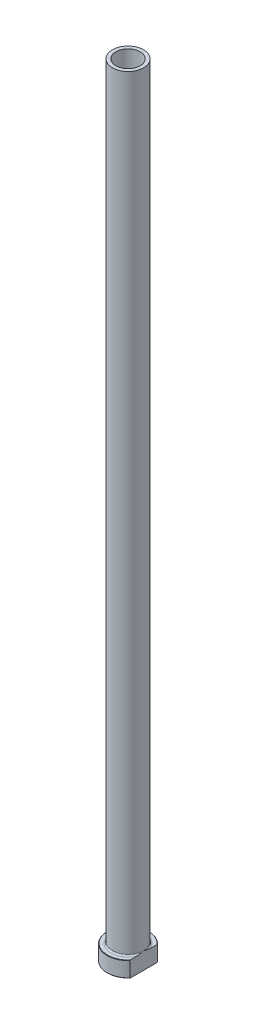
ISO-10303-21;
HEADER;
FILE_DESCRIPTION(('STEP AP214'),'2;1');
FILE_NAME('part.step','',(''),(''),'','','');
FILE_SCHEMA(('AUTOMOTIVE_DESIGN { 1 0 10303 214 1 1 1 1 }'));
ENDSEC;
DATA;
#1=APPLICATION_CONTEXT('core data for automotive mechanical design processes');
#2=APPLICATION_PROTOCOL_DEFINITION('international standard','automotive_design',2000,#1);
#3=PRODUCT_CONTEXT('',#1,'mechanical');
#4=PRODUCT('Part','Part','',(#3));
#5=PRODUCT_RELATED_PRODUCT_CATEGORY('part','',(#4));
#6=PRODUCT_DEFINITION_FORMATION('','',#4);
#7=PRODUCT_DEFINITION_CONTEXT('part definition',#1,'design');
#8=PRODUCT_DEFINITION('design','',#6,#7);
#9=PRODUCT_DEFINITION_SHAPE('','',#8);
#10=(LENGTH_UNIT() NAMED_UNIT(*) SI_UNIT(.MILLI.,.METRE.));
#11=(NAMED_UNIT(*) PLANE_ANGLE_UNIT() SI_UNIT($,.RADIAN.));
#12=(NAMED_UNIT(*) SI_UNIT($,.STERADIAN.) SOLID_ANGLE_UNIT());
#13=UNCERTAINTY_MEASURE_WITH_UNIT(LENGTH_MEASURE(1.E-05),#10,'distance_accuracy_value','');
#14=(GEOMETRIC_REPRESENTATION_CONTEXT(3) GLOBAL_UNCERTAINTY_ASSIGNED_CONTEXT((#13)) GLOBAL_UNIT_ASSIGNED_CONTEXT((#10,
#11,#12)) REPRESENTATION_CONTEXT('',''));
#15=CARTESIAN_POINT('',(0.,0.,0.));
#16=DIRECTION('',(0.,0.,1.));
#17=DIRECTION('',(1.,0.,0.));
#18=AXIS2_PLACEMENT_3D('',#15,#16,#17);
#19=CARTESIAN_POINT('',(0.,92.1876809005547,0.));
#20=DIRECTION('',(0.,1.,0.));
#21=DIRECTION('',(0.,0.,1.));
#22=AXIS2_PLACEMENT_3D('',#19,#20,#21);
#23=CYLINDRICAL_SURFACE('',#22,7.00000000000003);
#24=CARTESIAN_POINT('',(0.,450.,0.));
#25=DIRECTION('',(0.,1.,0.));
#26=DIRECTION('',(0.,0.,1.));
#27=AXIS2_PLACEMENT_3D('',#24,#25,#26);
#28=CIRCLE('',#27,7.00000000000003);
#29=CARTESIAN_POINT('',(0.,450.,7.00000000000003));
#30=VERTEX_POINT('',#29);
#31=EDGE_CURVE('E167',#30,#30,#28,.T.);
#32=ORIENTED_EDGE('',*,*,#31,.T.);
#33=EDGE_LOOP('',(#32));
#34=FACE_BOUND('',#33,.T.);
#35=CARTESIAN_POINT('',(0.,395.,0.));
#36=DIRECTION('',(0.,1.,0.));
#37=DIRECTION('',(0.,0.,1.));
#38=AXIS2_PLACEMENT_3D('',#35,#36,#37);
#39=CIRCLE('',#38,7.00000000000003);
#40=CARTESIAN_POINT('',(0.,395.,7.00000000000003));
#41=VERTEX_POINT('',#40);
#42=EDGE_CURVE('E170',#41,#41,#39,.T.);
#43=ORIENTED_EDGE('',*,*,#42,.F.);
#44=EDGE_LOOP('',(#43));
#45=FACE_BOUND('',#44,.T.);
#46=ADVANCED_FACE('F32',(#34,#45),#23,.F.);
#47=CARTESIAN_POINT('',(-7.00000000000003,450.,0.));
#48=DIRECTION('',(0.,1.,0.));
#49=DIRECTION('',(0.,0.,1.));
#50=AXIS2_PLACEMENT_3D('',#47,#48,#49);
#51=PLANE('',#50);
#52=CARTESIAN_POINT('',(0.,450.,0.));
#53=DIRECTION('',(0.,1.,0.));
#54=DIRECTION('',(0.,0.,1.));
#55=AXIS2_PLACEMENT_3D('',#52,#53,#54);
#56=CIRCLE('',#55,9.00000000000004);
#57=CARTESIAN_POINT('',(0.,450.,9.00000000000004));
#58=VERTEX_POINT('',#57);
#59=EDGE_CURVE('E174',#58,#58,#56,.T.);
#60=ORIENTED_EDGE('',*,*,#59,.T.);
#61=EDGE_LOOP('',(#60));
#62=FACE_BOUND('',#61,.T.);
#63=ORIENTED_EDGE('',*,*,#31,.F.);
#64=EDGE_LOOP('',(#63));
#65=FACE_BOUND('',#64,.T.);
#66=ADVANCED_FACE('F157',(#62,#65),#51,.T.);
#67=CARTESIAN_POINT('',(0.,92.1876809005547,0.));
#68=DIRECTION('',(0.,1.,0.));
#69=DIRECTION('',(0.,0.,1.));
#70=AXIS2_PLACEMENT_3D('',#67,#68,#69);
#71=CYLINDRICAL_SURFACE('',#70,9.00000000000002);
#72=CARTESIAN_POINT('',(0.,9.8,0.));
#73=DIRECTION('',(0.,1.,0.));
#74=DIRECTION('',(0.,0.,1.));
#75=AXIS2_PLACEMENT_3D('',#72,#73,#74);
#76=CIRCLE('',#75,9.00000000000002);
#77=CARTESIAN_POINT('',(9.00000000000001,9.8,0.));
#78=VERTEX_POINT('',#77);
#79=EDGE_CURVE('E180',#78,#78,#76,.T.);
#80=ORIENTED_EDGE('',*,*,#79,.T.);
#81=EDGE_LOOP('',(#80));
#82=FACE_BOUND('',#81,.T.);
#83=ORIENTED_EDGE('',*,*,#59,.F.);
#84=EDGE_LOOP('',(#83));
#85=FACE_BOUND('',#84,.T.);
#86=ADVANCED_FACE('F162',(#82,#85),#71,.T.);
#87=CARTESIAN_POINT('',(-8.99999999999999,9.,0.));
#88=DIRECTION('',(0.,1.,0.));
#89=DIRECTION('',(0.,0.,1.));
#90=AXIS2_PLACEMENT_3D('',#87,#88,#89);
#91=PLANE('',#90);
#92=DIRECTION('',(0.,0.,1.));
#93=VECTOR('',#92,1.);
#94=CARTESIAN_POINT('',(9.,9.,0.));
#95=LINE('',#94,#93);
#96=CARTESIAN_POINT('',(9.,9.,-7.63151361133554));
#97=VERTEX_POINT('',#96);
#98=CARTESIAN_POINT('',(9.,9.,-3.87814388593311));
#99=VERTEX_POINT('',#98);
#100=EDGE_CURVE('E54',#97,#99,#95,.T.);
#101=ORIENTED_EDGE('',*,*,#100,.F.);
#102=CARTESIAN_POINT('',(0.,9.,0.));
#103=DIRECTION('',(0.,1.,0.));
#104=DIRECTION('',(0.,0.,1.));
#105=AXIS2_PLACEMENT_3D('',#102,#103,#104);
#106=CIRCLE('',#105,11.8);
#107=CARTESIAN_POINT('',(8.99999999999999,9.,7.63151361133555));
#108=VERTEX_POINT('',#107);
#109=EDGE_CURVE('E186',#97,#108,#106,.T.);
#110=ORIENTED_EDGE('',*,*,#109,.T.);
#111=CARTESIAN_POINT('',(9.,9.,3.87814388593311));
#112=VERTEX_POINT('',#111);
#113=EDGE_CURVE('E134',#112,#108,#95,.T.);
#114=ORIENTED_EDGE('',*,*,#113,.F.);
#115=CARTESIAN_POINT('',(0.,9.,0.));
#116=DIRECTION('',(0.,1.,0.));
#117=DIRECTION('',(0.,0.,1.));
#118=AXIS2_PLACEMENT_3D('',#115,#116,#117);
#119=CIRCLE('',#118,9.80000000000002);
#120=EDGE_CURVE('E183',#112,#99,#119,.F.);
#121=ORIENTED_EDGE('',*,*,#120,.T.);
#122=EDGE_LOOP('',(#101,#110,#114,#121));
#123=FACE_BOUND('',#122,.T.);
#124=ADVANCED_FACE('F197',(#123),#91,.T.);
#125=CARTESIAN_POINT('',(0.,92.1876809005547,0.));
#126=DIRECTION('',(0.,1.,0.));
#127=DIRECTION('',(0.,0.,1.));
#128=AXIS2_PLACEMENT_3D('',#125,#126,#127);
#129=CYLINDRICAL_SURFACE('',#128,12.);
#130=DIRECTION('',(0.,-1.,0.));
#131=VECTOR('',#130,1.);
#132=CARTESIAN_POINT('',(8.99999999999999,450.,7.93725393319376));
#133=LINE('',#132,#131);
#134=CARTESIAN_POINT('',(8.99999999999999,8.79999999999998,7.93725393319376));
#135=VERTEX_POINT('',#134);
#136=CARTESIAN_POINT('',(8.99999999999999,0.199999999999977,7.93725393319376));
#137=VERTEX_POINT('',#136);
#138=EDGE_CURVE('E82',#135,#137,#133,.T.);
#139=ORIENTED_EDGE('',*,*,#138,.F.);
#140=CARTESIAN_POINT('',(0.,8.79999999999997,0.));
#141=DIRECTION('',(0.,1.,0.));
#142=DIRECTION('',(0.,0.,1.));
#143=AXIS2_PLACEMENT_3D('',#140,#141,#142);
#144=CIRCLE('',#143,12.);
#145=CARTESIAN_POINT('',(9.,8.79999999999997,-7.93725393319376));
#146=VERTEX_POINT('',#145);
#147=EDGE_CURVE('E95',#135,#146,#144,.F.);
#148=ORIENTED_EDGE('',*,*,#147,.T.);
#149=DIRECTION('',(0.,-1.,0.));
#150=VECTOR('',#149,1.);
#151=CARTESIAN_POINT('',(9.,450.,-7.93725393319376));
#152=LINE('',#151,#150);
#153=CARTESIAN_POINT('',(9.,0.199999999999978,-7.93725393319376));
#154=VERTEX_POINT('',#153);
#155=EDGE_CURVE('E192',#146,#154,#152,.T.);
#156=ORIENTED_EDGE('',*,*,#155,.T.);
#157=CARTESIAN_POINT('',(0.,0.199999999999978,0.));
#158=DIRECTION('',(0.,-1.,0.));
#159=DIRECTION('',(0.,0.,-1.));
#160=AXIS2_PLACEMENT_3D('',#157,#158,#159);
#161=CIRCLE('',#160,12.);
#162=EDGE_CURVE('E98',#154,#137,#161,.F.);
#163=ORIENTED_EDGE('',*,*,#162,.T.);
#164=EDGE_LOOP('',(#139,#148,#156,#163));
#165=FACE_BOUND('',#164,.T.);
#166=ADVANCED_FACE('F190',(#165),#129,.T.);
#167=CARTESIAN_POINT('',(-12.,0.,0.));
#168=DIRECTION('',(0.,-1.,0.));
#169=DIRECTION('',(0.,0.,-1.));
#170=AXIS2_PLACEMENT_3D('',#167,#168,#169);
#171=PLANE('',#170);
#172=CARTESIAN_POINT('',(0.,0.,0.));
#173=DIRECTION('',(0.,-1.,0.));
#174=DIRECTION('',(0.,0.,-1.));
#175=AXIS2_PLACEMENT_3D('',#172,#173,#174);
#176=CIRCLE('',#175,7.74999999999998);
#177=CARTESIAN_POINT('',(0.,0.,-7.74999999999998));
#178=VERTEX_POINT('',#177);
#179=EDGE_CURVE('E40',#178,#178,#176,.F.);
#180=ORIENTED_EDGE('',*,*,#179,.T.);
#181=EDGE_LOOP('',(#180));
#182=FACE_BOUND('',#181,.T.);
#183=DIRECTION('',(0.,0.,-1.));
#184=VECTOR('',#183,1.);
#185=CARTESIAN_POINT('',(8.99999999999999,0.,7.93725393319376));
#186=LINE('',#185,#184);
#187=CARTESIAN_POINT('',(8.99999999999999,0.,7.63151361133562));
#188=VERTEX_POINT('',#187);
#189=CARTESIAN_POINT('',(9.,0.,-7.63151361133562));
#190=VERTEX_POINT('',#189);
#191=EDGE_CURVE('E47',#188,#190,#186,.T.);
#192=ORIENTED_EDGE('',*,*,#191,.F.);
#193=CARTESIAN_POINT('',(0.,0.,0.));
#194=DIRECTION('',(0.,-1.,0.));
#195=DIRECTION('',(0.,0.,-1.));
#196=AXIS2_PLACEMENT_3D('',#193,#194,#195);
#197=CIRCLE('',#196,11.8);
#198=EDGE_CURVE('E92',#188,#190,#197,.T.);
#199=ORIENTED_EDGE('',*,*,#198,.T.);
#200=EDGE_LOOP('',(#192,#199));
#201=FACE_BOUND('',#200,.T.);
#202=ADVANCED_FACE('F91',(#182,#201),#171,.T.);
#203=CARTESIAN_POINT('',(0.,92.1876809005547,0.));
#204=DIRECTION('',(0.,1.,0.));
#205=DIRECTION('',(0.,0.,1.));
#206=AXIS2_PLACEMENT_3D('',#203,#204,#205);
#207=CYLINDRICAL_SURFACE('',#206,7.25000000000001);
#208=CARTESIAN_POINT('',(0.,0.499999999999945,0.));
#209=DIRECTION('',(0.,-1.,0.));
#210=DIRECTION('',(0.,0.,-1.));
#211=AXIS2_PLACEMENT_3D('',#208,#209,#210);
#212=CIRCLE('',#211,7.25000000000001);
#213=CARTESIAN_POINT('',(0.,0.499999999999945,-7.25000000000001));
#214=VERTEX_POINT('',#213);
#215=EDGE_CURVE('E11',#214,#214,#212,.T.);
#216=ORIENTED_EDGE('',*,*,#215,.T.);
#217=EDGE_LOOP('',(#216));
#218=FACE_BOUND('',#217,.T.);
#219=CARTESIAN_POINT('',(0.,383.,0.));
#220=DIRECTION('',(0.,1.,0.));
#221=DIRECTION('',(0.,0.,1.));
#222=AXIS2_PLACEMENT_3D('',#219,#220,#221);
#223=CIRCLE('',#222,7.25000000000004);
#224=CARTESIAN_POINT('',(0.,383.,7.25000000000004));
#225=VERTEX_POINT('',#224);
#226=EDGE_CURVE('E172',#225,#225,#223,.T.);
#227=ORIENTED_EDGE('',*,*,#226,.T.);
#228=EDGE_LOOP('',(#227));
#229=FACE_BOUND('',#228,.T.);
#230=ADVANCED_FACE('F215',(#218,#229),#207,.F.);
#231=CARTESIAN_POINT('',(0.,383.,0.));
#232=DIRECTION('',(0.,-1.,0.));
#233=DIRECTION('',(0.,0.,-1.));
#234=AXIS2_PLACEMENT_3D('',#231,#232,#233);
#235=CONICAL_SURFACE('',#234,7.25000000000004,0.0208303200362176);
#236=ORIENTED_EDGE('',*,*,#42,.T.);
#237=EDGE_LOOP('',(#236));
#238=FACE_BOUND('',#237,.T.);
#239=ORIENTED_EDGE('',*,*,#226,.F.);
#240=EDGE_LOOP('',(#239));
#241=FACE_BOUND('',#240,.T.);
#242=ADVANCED_FACE('F111',(#238,#241),#235,.F.);
#243=CARTESIAN_POINT('',(0.,9.8,0.));
#244=DIRECTION('',(0.,1.,0.));
#245=DIRECTION('',(0.,0.,1.));
#246=AXIS2_PLACEMENT_3D('',#243,#244,#245);
#247=TOROIDAL_SURFACE('',#246,9.80000000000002,0.8);
#248=ORIENTED_EDGE('',*,*,#120,.F.);
#249=CARTESIAN_POINT('',(9.00000000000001,9.8,0.));
#250=CARTESIAN_POINT('',(9.00000000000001,9.80000101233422,-6.46830621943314E-11));
#251=CARTESIAN_POINT('',(9.00000000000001,9.80000202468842,3.1733283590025E-07));
#252=CARTESIAN_POINT('',(9.00000000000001,9.80000393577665,1.24154807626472E-06));
#253=CARTESIAN_POINT('',(9.00000000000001,9.80000482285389,1.86583130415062E-06));
#254=CARTESIAN_POINT('',(9.00000000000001,9.80000663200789,3.3564144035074E-06));
#255=CARTESIAN_POINT('',(9.00000000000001,9.80000753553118,4.24567538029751E-06));
#256=CARTESIAN_POINT('',(9.00000000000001,9.80000918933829,6.1161236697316E-06));
#257=CARTESIAN_POINT('',(9.00000000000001,9.80000994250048,7.09492192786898E-06));
#258=CARTESIAN_POINT('',(9.00000000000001,9.80001263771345,1.07802732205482E-05));
#259=CARTESIAN_POINT('',(9.00000000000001,9.80001442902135,1.36008627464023E-05));
#260=CARTESIAN_POINT('',(9.00000000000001,9.80001746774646,1.9272257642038E-05));
#261=CARTESIAN_POINT('',(9.00000000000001,9.80001874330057,2.21087258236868E-05));
#262=CARTESIAN_POINT('',(9.00000000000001,9.80002390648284,3.37975105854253E-05));
#263=CARTESIAN_POINT('',(9.,9.80002763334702,4.27293258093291E-05));
#264=CARTESIAN_POINT('',(9.,9.80003330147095,5.98324910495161E-05));
#265=CARTESIAN_POINT('',(9.,9.80003541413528,6.79473053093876E-05));
#266=CARTESIAN_POINT('',(9.00000000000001,9.80005049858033,0.000127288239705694));
#267=CARTESIAN_POINT('',(9.,9.80006163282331,0.000178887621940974));
#268=CARTESIAN_POINT('',(8.99999999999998,9.80011034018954,0.000381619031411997));
#269=CARTESIAN_POINT('',(8.99999999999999,9.80015710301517,0.000530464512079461));
#270=CARTESIAN_POINT('',(9.00000000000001,9.80033804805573,0.00111728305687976));
#271=CARTESIAN_POINT('',(9.,9.80046603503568,0.00155660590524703));
#272=CARTESIAN_POINT('',(8.99999999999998,9.80097635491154,0.00329406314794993));
#273=CARTESIAN_POINT('',(8.99999999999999,9.8013663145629,0.00459050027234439));
#274=CARTESIAN_POINT('',(9.00000000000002,9.80298403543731,0.00998416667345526));
#275=CARTESIAN_POINT('',(9.00000000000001,9.80420236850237,0.0140834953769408));
#276=CARTESIAN_POINT('',(8.99999999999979,9.8264866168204,0.0890427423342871));
#277=CARTESIAN_POINT('',(8.99999999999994,9.84764626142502,0.15988211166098));
#278=CARTESIAN_POINT('',(9.00000000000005,9.88895908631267,0.298764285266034));
#279=CARTESIAN_POINT('',(9.00000000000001,9.90911860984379,0.366805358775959));
#280=CARTESIAN_POINT('',(8.99999999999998,9.95179311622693,0.511524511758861));
#281=CARTESIAN_POINT('',(8.99999999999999,9.97428452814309,0.588209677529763));
#282=CARTESIAN_POINT('',(9.,10.0191408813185,0.742532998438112));
#283=CARTESIAN_POINT('',(9.,10.0415017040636,0.820172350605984));
#284=CARTESIAN_POINT('',(9.,10.0794112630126,0.953448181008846));
#285=CARTESIAN_POINT('',(9.,10.0950851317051,1.00904901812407));
#286=CARTESIAN_POINT('',(9.,10.1260784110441,1.12019530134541));
#287=CARTESIAN_POINT('',(9.,10.141398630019,1.17574052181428));
#288=CARTESIAN_POINT('',(9.,10.1860703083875,1.33980716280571));
#289=CARTESIAN_POINT('',(9.,10.2149083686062,1.4484686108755));
#290=CARTESIAN_POINT('',(9.,10.2856369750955,1.7241783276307));
#291=CARTESIAN_POINT('',(9.,10.3263124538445,1.89154391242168));
#292=CARTESIAN_POINT('',(9.,10.4020454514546,2.22904779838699));
#293=CARTESIAN_POINT('',(9.,10.4370523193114,2.3991975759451));
#294=CARTESIAN_POINT('',(9.,10.5014391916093,2.75494052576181));
#295=CARTESIAN_POINT('',(9.,10.5301301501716,2.94066439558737));
#296=CARTESIAN_POINT('',(9.,10.5633122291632,3.22016202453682));
#297=CARTESIAN_POINT('',(9.,10.5727244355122,3.3133533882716));
#298=CARTESIAN_POINT('',(9.,10.5877042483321,3.5000389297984));
#299=CARTESIAN_POINT('',(9.,10.5932725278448,3.59353305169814));
#300=CARTESIAN_POINT('',(9.,10.5997812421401,3.77831079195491));
#301=CARTESIAN_POINT('',(9.,10.6008358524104,3.86959010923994));
#302=CARTESIAN_POINT('',(9.,10.5977997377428,4.05215299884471));
#303=CARTESIAN_POINT('',(8.99999999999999,10.5937049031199,4.14343651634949));
#304=CARTESIAN_POINT('',(8.99999999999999,10.5793848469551,4.32415905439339));
#305=CARTESIAN_POINT('',(8.99999999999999,10.5692536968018,4.41360502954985));
#306=CARTESIAN_POINT('',(8.99999999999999,10.5415393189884,4.59125765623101));
#307=CARTESIAN_POINT('',(8.99999999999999,10.5239649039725,4.67946564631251));
#308=CARTESIAN_POINT('',(8.99999999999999,10.4790565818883,4.8547188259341));
#309=CARTESIAN_POINT('',(8.99999999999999,10.4516029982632,4.94173554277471));
#310=CARTESIAN_POINT('',(8.99999999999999,10.4007972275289,5.06830195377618));
#311=CARTESIAN_POINT('',(8.99999999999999,10.3822808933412,5.10979172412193));
#312=CARTESIAN_POINT('',(8.99999999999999,10.3414775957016,5.19085457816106));
#313=CARTESIAN_POINT('',(8.99999999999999,10.319195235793,5.23042992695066));
#314=CARTESIAN_POINT('',(8.99999999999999,10.2750362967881,5.29920261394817));
#315=CARTESIAN_POINT('',(8.99999999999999,10.2539514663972,5.32890420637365));
#316=CARTESIAN_POINT('',(8.99999999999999,10.2085010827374,5.38577147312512));
#317=CARTESIAN_POINT('',(8.99999999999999,10.1841327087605,5.412934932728));
#318=CARTESIAN_POINT('',(8.99999999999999,10.1314615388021,5.46389233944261));
#319=CARTESIAN_POINT('',(8.99999999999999,10.103115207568,5.48764214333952));
#320=CARTESIAN_POINT('',(8.99999999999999,10.0426124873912,5.52966859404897));
#321=CARTESIAN_POINT('',(8.99999999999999,10.0104678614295,5.54796155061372));
#322=CARTESIAN_POINT('',(8.99999999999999,9.95377518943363,5.57238639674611));
#323=CARTESIAN_POINT('',(8.99999999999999,9.93009823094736,5.58053697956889));
#324=CARTESIAN_POINT('',(8.99999999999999,9.88171464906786,5.59278453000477));
#325=CARTESIAN_POINT('',(8.99999999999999,9.85700894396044,5.59688503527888));
#326=CARTESIAN_POINT('',(8.99999999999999,9.80717489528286,5.6006769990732));
#327=CARTESIAN_POINT('',(8.99999999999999,9.78204544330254,5.60035415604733));
#328=CARTESIAN_POINT('',(8.99999999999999,9.73223420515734,5.59529565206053));
#329=CARTESIAN_POINT('',(8.99999999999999,9.70755259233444,5.59055831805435));
#330=CARTESIAN_POINT('',(8.99999999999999,9.66020362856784,5.57733425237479));
#331=CARTESIAN_POINT('',(8.99999999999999,9.63749568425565,5.56898983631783));
#332=CARTESIAN_POINT('',(8.99999999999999,9.59351516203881,5.54915687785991));
#333=CARTESIAN_POINT('',(8.99999999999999,9.57224307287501,5.53766727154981));
#334=CARTESIAN_POINT('',(8.99999999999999,9.51928150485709,5.50462580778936));
#335=CARTESIAN_POINT('',(8.99999999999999,9.48880776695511,5.48112661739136));
#336=CARTESIAN_POINT('',(8.99999999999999,9.43189052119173,5.4296533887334));
#337=CARTESIAN_POINT('',(8.99999999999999,9.40546009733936,5.40166539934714));
#338=CARTESIAN_POINT('',(8.99999999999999,9.34005551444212,5.32319042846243));
#339=CARTESIAN_POINT('',(8.99999999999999,9.30430472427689,5.27003866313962));
#340=CARTESIAN_POINT('',(8.99999999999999,9.24095813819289,5.15926391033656));
#341=CARTESIAN_POINT('',(8.99999999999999,9.21336826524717,5.10163771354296));
#342=CARTESIAN_POINT('',(8.99999999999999,9.16551403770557,4.98579619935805));
#343=CARTESIAN_POINT('',(8.99999999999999,9.14502939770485,4.9276701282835));
#344=CARTESIAN_POINT('',(8.99999999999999,9.10900516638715,4.80987690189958));
#345=CARTESIAN_POINT('',(8.99999999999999,9.09347054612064,4.75020826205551));
#346=CARTESIAN_POINT('',(8.99999999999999,9.06639912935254,4.62926355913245));
#347=CARTESIAN_POINT('',(8.99999999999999,9.05491059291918,4.56797688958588));
#348=CARTESIAN_POINT('',(8.99999999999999,9.03554988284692,4.44488746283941));
#349=CARTESIAN_POINT('',(8.99999999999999,9.02767548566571,4.38308504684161));
#350=CARTESIAN_POINT('',(8.99999999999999,9.01237706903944,4.23320098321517));
#351=CARTESIAN_POINT('',(8.99999999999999,9.00652460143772,4.14495990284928));
#352=CARTESIAN_POINT('',(8.99999999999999,8.99996624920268,3.96827125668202));
#353=CARTESIAN_POINT('',(9.,8.99926276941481,3.87982361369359));
#354=CARTESIAN_POINT('',(9.,9.00218728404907,3.70272096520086));
#355=CARTESIAN_POINT('',(9.,9.00582939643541,3.61406622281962));
#356=CARTESIAN_POINT('',(9.,9.01681466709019,3.43698088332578));
#357=CARTESIAN_POINT('',(9.,9.02415848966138,3.34855032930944));
#358=CARTESIAN_POINT('',(9.,9.0498974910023,3.09391807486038));
#359=CARTESIAN_POINT('',(9.,9.07232194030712,2.92812217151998));
#360=CARTESIAN_POINT('',(9.,9.12539895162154,2.59921508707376));
#361=CARTESIAN_POINT('',(9.,9.15598725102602,2.4360930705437));
#362=CARTESIAN_POINT('',(9.,9.22330285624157,2.11182788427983));
#363=CARTESIAN_POINT('',(9.,9.26000471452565,1.95067936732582));
#364=CARTESIAN_POINT('',(9.,9.31897632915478,1.70786584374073));
#365=CARTESIAN_POINT('',(9.,9.33955107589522,1.62578051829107));
#366=CARTESIAN_POINT('',(9.,9.38177259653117,1.46165638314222));
#367=CARTESIAN_POINT('',(9.,9.4034220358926,1.37961825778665));
#368=CARTESIAN_POINT('',(9.,9.45602430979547,1.18435079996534));
#369=CARTESIAN_POINT('',(8.99999999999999,9.48736095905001,1.07122519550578));
#370=CARTESIAN_POINT('',(9.,9.55083956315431,0.846545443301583));
#371=CARTESIAN_POINT('',(9.,9.58296886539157,0.734987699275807));
#372=CARTESIAN_POINT('',(8.99999999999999,9.64431039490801,0.524609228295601));
#373=CARTESIAN_POINT('',(8.99999999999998,9.67344475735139,0.425765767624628));
#374=CARTESIAN_POINT('',(9.00000000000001,9.71808680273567,0.275077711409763));
#375=CARTESIAN_POINT('',(9.00000000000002,9.73349584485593,0.223203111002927));
#376=CARTESIAN_POINT('',(8.99999999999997,9.76415269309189,0.120285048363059));
#377=CARTESIAN_POINT('',(8.99999999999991,9.7793992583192,0.0692412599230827));
#378=CARTESIAN_POINT('',(9.,9.79579831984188,0.0140813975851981));
#379=CARTESIAN_POINT('',(9.00000000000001,9.797017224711,0.00997994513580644));
#380=CARTESIAN_POINT('',(8.99999999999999,9.798635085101,0.00458578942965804));
#381=CARTESIAN_POINT('',(8.99999999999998,9.79902455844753,0.00329097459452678));
#382=CARTESIAN_POINT('',(9.,9.79953428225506,0.00155554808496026));
#383=CARTESIAN_POINT('',(9.00000000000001,9.79966215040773,0.00111663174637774));
#384=CARTESIAN_POINT('',(8.99999999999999,9.79984295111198,0.000530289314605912));
#385=CARTESIAN_POINT('',(8.99999999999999,9.79988969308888,0.000381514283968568));
#386=CARTESIAN_POINT('',(9.,9.79993838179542,0.000178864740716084));
#387=CARTESIAN_POINT('',(9.,9.79994951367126,0.000127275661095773));
#388=CARTESIAN_POINT('',(9.,9.79996459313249,6.79451451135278E-05));
#389=CARTESIAN_POINT('',(9.,9.79996670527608,5.98309419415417E-05));
#390=CARTESIAN_POINT('',(9.,9.79997237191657,4.27289936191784E-05));
#391=CARTESIAN_POINT('',(9.00000000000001,9.79997609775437,3.37977524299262E-05));
#392=CARTESIAN_POINT('',(9.00000000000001,9.79998125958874,2.2109549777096E-05));
#393=CARTESIAN_POINT('',(9.00000000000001,9.79998253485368,1.92731271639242E-05));
#394=CARTESIAN_POINT('',(9.00000000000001,9.79998557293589,1.36017724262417E-05));
#395=CARTESIAN_POINT('',(9.00000000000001,9.79998736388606,1.0781172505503E-05));
#396=CARTESIAN_POINT('',(9.00000000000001,9.79999005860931,7.09574685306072E-06));
#397=CARTESIAN_POINT('',(9.00000000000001,9.79999081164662,6.11691365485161E-06));
#398=CARTESIAN_POINT('',(9.00000000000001,9.79999246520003,4.24637297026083E-06));
#399=CARTESIAN_POINT('',(9.00000000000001,9.79999336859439,3.3570539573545E-06));
#400=CARTESIAN_POINT('',(9.00000000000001,9.7999951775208,1.86633287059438E-06));
#401=CARTESIAN_POINT('',(9.00000000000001,9.79999606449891,1.24197414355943E-06));
#402=CARTESIAN_POINT('',(9.00000000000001,9.79999797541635,3.17571256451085E-07));
#403=CARTESIAN_POINT('',(9.00000000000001,9.79999898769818,6.46849264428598E-11));
#404=CARTESIAN_POINT('',(9.00000000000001,9.8,0.));
#405=B_SPLINE_CURVE_WITH_KNOTS('',3,(#249,#250,#251,#252,#253,#254,#255,#256,#257,#258,#259,
#260,#261,#262,#263,#264,#265,#266,#267,#268,#269,#270,#271,#272,#273,#274,#275,#276,#277,#278,
#279,#280,#281,#282,#283,#284,#285,#286,#287,#288,#289,#290,#291,#292,#293,#294,#295,#296,#297,
#298,#299,#300,#301,#302,#303,#304,#305,#306,#307,#308,#309,#310,#311,#312,#313,#314,#315,#316,
#317,#318,#319,#320,#321,#322,#323,#324,#325,#326,#327,#328,#329,#330,#331,#332,#333,#334,#335,
#336,#337,#338,#339,#340,#341,#342,#343,#344,#345,#346,#347,#348,#349,#350,#351,#352,#353,#354,
#355,#356,#357,#358,#359,#360,#361,#362,#363,#364,#365,#366,#367,#368,#369,#370,#371,#372,#373,
#374,#375,#376,#377,#378,#379,#380,#381,#382,#383,#384,#385,#386,#387,#388,#389,#390,#391,#392,
#393,#394,#395,#396,#397,#398,#399,#400,#401,#402,#403,#404),.UNSPECIFIED.,.T.,.F.,(4,2,2,2,2,2,
2,2,2,2,2,2,2,2,2,2,2,2,2,2,2,2,2,2,2,2,2,2,2,2,2,2,2,2,2,2,2,2,2,2,2,2,2,2,2,2,2,2,2,2,2,2,2,2,
2,2,2,2,2,2,2,2,2,2,2,2,2,2,2,2,2,2,2,2,2,2,2,4),(0.,3.04771180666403E-06,6.29345362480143E-06,
1.00769754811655E-05,1.37791057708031E-05,2.37619192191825E-05,3.30844682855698E-05,
6.20551823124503E-05,8.71784871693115E-05,0.000245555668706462,0.000713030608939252,
0.0020863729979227,0.00614710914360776,0.0189775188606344,0.240764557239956,0.453660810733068,
0.693405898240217,0.9357904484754,1.10909318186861,1.28194996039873,1.61921055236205,
2.13583880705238,2.6568550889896,3.22023907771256,3.50117319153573,3.78205810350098,
4.055794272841,4.32974904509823,4.59954218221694,4.86901677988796,5.14187221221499,
5.27802968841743,5.41402191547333,5.52311134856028,5.63229509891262,5.74278355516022,
5.85293838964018,5.9277557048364,6.00250761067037,6.07750126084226,6.15252334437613,
6.2248226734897,6.29714648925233,6.41192958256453,6.52707659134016,6.71816463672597,
6.90939103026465,7.09400621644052,7.27880622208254,7.46574121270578,7.65256103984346,
7.91766914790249,8.18290106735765,8.44899702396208,8.71514075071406,9.21672782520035,
9.71447745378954,10.2102047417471,10.4640739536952,10.718607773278,11.070755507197,
11.4190290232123,11.7281703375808,11.8905163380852,12.0503265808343,12.0631635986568,
12.0672192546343,12.0685913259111,12.0690585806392,12.0692169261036,12.0692420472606,
12.0692710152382,12.0692803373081,12.069290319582,12.0692940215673,12.069297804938,
12.0693010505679,12.0693040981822),.UNSPECIFIED.);
#406=EDGE_CURVE('E126',#112,#78,#405,.T.);
#407=ORIENTED_EDGE('',*,*,#406,.T.);
#408=ORIENTED_EDGE('',*,*,#79,.F.);
#409=CARTESIAN_POINT('',(9.00000000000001,9.8,0.));
#410=CARTESIAN_POINT('',(9.00000000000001,9.79999898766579,6.46870007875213E-11));
#411=CARTESIAN_POINT('',(9.00000000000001,9.79999797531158,-3.17332831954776E-07));
#412=CARTESIAN_POINT('',(9.00000000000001,9.79999606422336,-1.24154807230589E-06));
#413=CARTESIAN_POINT('',(9.00000000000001,9.79999517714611,-1.86583130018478E-06));
#414=CARTESIAN_POINT('',(9.00000000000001,9.79999336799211,-3.35641439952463E-06));
#415=CARTESIAN_POINT('',(9.00000000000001,9.79999246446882,-4.24567537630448E-06));
#416=CARTESIAN_POINT('',(9.00000000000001,9.79999081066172,-6.11612366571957E-06));
#417=CARTESIAN_POINT('',(9.00000000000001,9.79999005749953,-7.09492192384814E-06));
#418=CARTESIAN_POINT('',(9.00000000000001,9.79998736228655,-1.07802732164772E-05));
#419=CARTESIAN_POINT('',(9.00000000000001,9.79998557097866,-1.36008627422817E-05));
#420=CARTESIAN_POINT('',(9.00000000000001,9.79998253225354,-1.92722576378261E-05));
#421=CARTESIAN_POINT('',(9.00000000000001,9.79998125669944,-2.21087258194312E-05));
#422=CARTESIAN_POINT('',(9.00000000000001,9.79997609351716,-3.379751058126E-05));
#423=CARTESIAN_POINT('',(9.,9.79997236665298,-4.2729325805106E-05));
#424=CARTESIAN_POINT('',(9.,9.79996669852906,-5.98324910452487E-05));
#425=CARTESIAN_POINT('',(9.,9.79996458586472,-6.79473053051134E-05));
#426=CARTESIAN_POINT('',(9.,9.79994950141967,-0.000127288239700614));
#427=CARTESIAN_POINT('',(9.,9.79993836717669,-0.000178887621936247));
#428=CARTESIAN_POINT('',(8.99999999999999,9.79988965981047,-0.00038161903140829));
#429=CARTESIAN_POINT('',(8.99999999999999,9.79984289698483,-0.000530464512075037));
#430=CARTESIAN_POINT('',(9.00000000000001,9.79966195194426,-0.00111728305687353));
#431=CARTESIAN_POINT('',(9.,9.79953396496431,-0.00155660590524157));
#432=CARTESIAN_POINT('',(8.99999999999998,9.79902364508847,-0.003294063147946));
#433=CARTESIAN_POINT('',(8.99999999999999,9.7986336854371,-0.00459050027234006));
#434=CARTESIAN_POINT('',(9.00000000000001,9.79701596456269,-0.00998416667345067));
#435=CARTESIAN_POINT('',(9.,9.79579763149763,-0.0140834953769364));
#436=CARTESIAN_POINT('',(8.99999999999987,9.77351338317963,-0.0890427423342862));
#437=CARTESIAN_POINT('',(8.99999999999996,9.75235373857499,-0.159882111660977));
#438=CARTESIAN_POINT('',(9.00000000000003,9.71104091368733,-0.298764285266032));
#439=CARTESIAN_POINT('',(9.00000000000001,9.69088139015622,-0.36680535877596));
#440=CARTESIAN_POINT('',(8.99999999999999,9.64820688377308,-0.511524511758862));
#441=CARTESIAN_POINT('',(8.99999999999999,9.62571547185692,-0.588209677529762));
#442=CARTESIAN_POINT('',(9.,9.58085911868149,-0.742532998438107));
#443=CARTESIAN_POINT('',(9.,9.55849829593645,-0.820172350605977));
#444=CARTESIAN_POINT('',(9.,9.52058873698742,-0.953448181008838));
#445=CARTESIAN_POINT('',(9.,9.50491486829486,-1.00904901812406));
#446=CARTESIAN_POINT('',(9.,9.47392158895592,-1.12019530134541));
#447=CARTESIAN_POINT('',(9.,9.45860136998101,-1.17574052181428));
#448=CARTESIAN_POINT('',(9.,9.41392969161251,-1.33980716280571));
#449=CARTESIAN_POINT('',(9.,9.38509163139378,-1.4484686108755));
#450=CARTESIAN_POINT('',(9.,9.3143630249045,-1.72417832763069));
#451=CARTESIAN_POINT('',(9.,9.27368754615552,-1.89154391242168));
#452=CARTESIAN_POINT('',(9.,9.19795454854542,-2.22904779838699));
#453=CARTESIAN_POINT('',(9.,9.16294768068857,-2.3991975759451));
#454=CARTESIAN_POINT('',(9.,9.09856080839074,-2.7549405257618));
#455=CARTESIAN_POINT('',(9.,9.06986984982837,-2.94066439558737));
#456=CARTESIAN_POINT('',(9.,9.03668777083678,-3.22016202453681));
#457=CARTESIAN_POINT('',(9.,9.02727556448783,-3.31335338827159));
#458=CARTESIAN_POINT('',(9.,9.01229575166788,-3.50003892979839));
#459=CARTESIAN_POINT('',(9.,9.00672747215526,-3.59353305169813));
#460=CARTESIAN_POINT('',(9.,9.00021875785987,-3.7783107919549));
#461=CARTESIAN_POINT('',(9.,8.99916414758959,-3.86959010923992));
#462=CARTESIAN_POINT('',(9.,9.00220026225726,-4.05215299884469));
#463=CARTESIAN_POINT('',(9.,9.00629509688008,-4.14343651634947));
#464=CARTESIAN_POINT('',(9.,9.0206151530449,-4.32415905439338));
#465=CARTESIAN_POINT('',(9.,9.0307463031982,-4.41360502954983));
#466=CARTESIAN_POINT('',(9.,9.05846068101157,-4.59125765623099));
#467=CARTESIAN_POINT('',(9.,9.07603509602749,-4.67946564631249));
#468=CARTESIAN_POINT('',(9.,9.12094341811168,-4.85471882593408));
#469=CARTESIAN_POINT('',(9.,9.14839700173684,-4.94173554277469));
#470=CARTESIAN_POINT('',(9.,9.19920277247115,-5.06830195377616));
#471=CARTESIAN_POINT('',(9.,9.21771910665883,-5.10979172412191));
#472=CARTESIAN_POINT('',(9.,9.25852240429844,-5.19085457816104));
#473=CARTESIAN_POINT('',(9.,9.28080476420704,-5.23042992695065));
#474=CARTESIAN_POINT('',(9.,9.32496370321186,-5.29920261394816));
#475=CARTESIAN_POINT('',(9.,9.34604853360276,-5.32890420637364));
#476=CARTESIAN_POINT('',(9.,9.39149891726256,-5.38577147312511));
#477=CARTESIAN_POINT('',(9.,9.41586729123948,-5.41293493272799));
#478=CARTESIAN_POINT('',(9.,9.46853846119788,-5.4638923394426));
#479=CARTESIAN_POINT('',(9.,9.49688479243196,-5.48764214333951));
#480=CARTESIAN_POINT('',(9.,9.55738751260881,-5.52966859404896));
#481=CARTESIAN_POINT('',(9.,9.58953213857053,-5.54796155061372));
#482=CARTESIAN_POINT('',(9.,9.64622481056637,-5.57238639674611));
#483=CARTESIAN_POINT('',(9.,9.66990176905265,-5.58053697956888));
#484=CARTESIAN_POINT('',(9.,9.71828535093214,-5.59278453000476));
#485=CARTESIAN_POINT('',(9.,9.74299105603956,-5.59688503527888));
#486=CARTESIAN_POINT('',(9.,9.79282510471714,-5.60067699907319));
#487=CARTESIAN_POINT('',(9.,9.81795455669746,-5.60035415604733));
#488=CARTESIAN_POINT('',(9.,9.86776579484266,-5.59529565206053));
#489=CARTESIAN_POINT('',(9.,9.89244740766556,-5.59055831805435));
#490=CARTESIAN_POINT('',(9.,9.93979637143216,-5.57733425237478));
#491=CARTESIAN_POINT('',(9.,9.96250431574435,-5.56898983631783));
#492=CARTESIAN_POINT('',(9.,10.0064848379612,-5.5491568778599));
#493=CARTESIAN_POINT('',(9.,10.027756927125,-5.53766727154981));
#494=CARTESIAN_POINT('',(9.,10.0807184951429,-5.50462580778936));
#495=CARTESIAN_POINT('',(9.,10.1111922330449,-5.48112661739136));
#496=CARTESIAN_POINT('',(9.,10.1681094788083,-5.4296533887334));
#497=CARTESIAN_POINT('',(9.,10.1945399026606,-5.40166539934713));
#498=CARTESIAN_POINT('',(9.,10.2599444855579,-5.32319042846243));
#499=CARTESIAN_POINT('',(9.,10.2956952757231,-5.27003866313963));
#500=CARTESIAN_POINT('',(9.,10.3590418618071,-5.15926391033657));
#501=CARTESIAN_POINT('',(9.,10.3866317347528,-5.10163771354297));
#502=CARTESIAN_POINT('',(9.,10.4344859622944,-4.98579619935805));
#503=CARTESIAN_POINT('',(9.,10.4549706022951,-4.92767012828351));
#504=CARTESIAN_POINT('',(9.,10.4909948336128,-4.80987690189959));
#505=CARTESIAN_POINT('',(9.,10.5065294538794,-4.75020826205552));
#506=CARTESIAN_POINT('',(9.,10.5336008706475,-4.62926355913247));
#507=CARTESIAN_POINT('',(9.,10.5450894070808,-4.56797688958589));
#508=CARTESIAN_POINT('',(9.,10.5644501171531,-4.44488746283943));
#509=CARTESIAN_POINT('',(9.,10.5723245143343,-4.38308504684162));
#510=CARTESIAN_POINT('',(9.,10.5876229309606,-4.23320098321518));
#511=CARTESIAN_POINT('',(9.,10.5934753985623,-4.1449599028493));
#512=CARTESIAN_POINT('',(9.,10.6000337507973,-3.96827125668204));
#513=CARTESIAN_POINT('',(9.,10.6007372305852,-3.87982361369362));
#514=CARTESIAN_POINT('',(9.,10.5978127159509,-3.70272096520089));
#515=CARTESIAN_POINT('',(9.,10.5941706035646,-3.61406622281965));
#516=CARTESIAN_POINT('',(9.,10.5831853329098,-3.43698088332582));
#517=CARTESIAN_POINT('',(9.,10.5758415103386,-3.34855032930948));
#518=CARTESIAN_POINT('',(9.,10.5501025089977,-3.09391807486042));
#519=CARTESIAN_POINT('',(9.,10.5276780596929,-2.92812217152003));
#520=CARTESIAN_POINT('',(9.,10.4746010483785,-2.59921508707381));
#521=CARTESIAN_POINT('',(9.,10.444012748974,-2.43609307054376));
#522=CARTESIAN_POINT('',(9.,10.3766971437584,-2.11182788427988));
#523=CARTESIAN_POINT('',(9.,10.3399952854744,-1.95067936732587));
#524=CARTESIAN_POINT('',(9.,10.2810236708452,-1.70786584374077));
#525=CARTESIAN_POINT('',(9.,10.2604489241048,-1.62578051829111));
#526=CARTESIAN_POINT('',(9.,10.2182274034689,-1.46165638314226));
#527=CARTESIAN_POINT('',(9.,10.1965779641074,-1.37961825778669));
#528=CARTESIAN_POINT('',(9.,10.1439756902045,-1.18435079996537));
#529=CARTESIAN_POINT('',(8.99999999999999,10.11263904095,-1.07122519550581));
#530=CARTESIAN_POINT('',(9.,10.0491604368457,-0.84654544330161));
#531=CARTESIAN_POINT('',(9.,10.0170311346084,-0.73498769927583));
#532=CARTESIAN_POINT('',(8.99999999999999,9.955689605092,-0.524609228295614));
#533=CARTESIAN_POINT('',(8.99999999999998,9.92655524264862,-0.425765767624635));
#534=CARTESIAN_POINT('',(9.00000000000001,9.88191319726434,-0.275077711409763));
#535=CARTESIAN_POINT('',(9.00000000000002,9.86650415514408,-0.223203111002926));
#536=CARTESIAN_POINT('',(8.99999999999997,9.83584730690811,-0.120285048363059));
#537=CARTESIAN_POINT('',(8.99999999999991,9.8206007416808,-0.0692412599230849));
#538=CARTESIAN_POINT('',(9.,9.80420168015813,-0.014081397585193));
#539=CARTESIAN_POINT('',(9.00000000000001,9.80298277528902,-0.0099799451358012));
#540=CARTESIAN_POINT('',(8.99999999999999,9.80136491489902,-0.00458578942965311));
#541=CARTESIAN_POINT('',(8.99999999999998,9.80097544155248,-0.00329097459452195));
#542=CARTESIAN_POINT('',(9.,9.80046571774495,-0.00155554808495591));
#543=CARTESIAN_POINT('',(9.00000000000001,9.80033784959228,-0.00111663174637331));
#544=CARTESIAN_POINT('',(8.99999999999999,9.80015704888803,-0.000530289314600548));
#545=CARTESIAN_POINT('',(8.99999999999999,9.80011030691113,-0.000381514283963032));
#546=CARTESIAN_POINT('',(9.,9.80006161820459,-0.000178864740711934));
#547=CARTESIAN_POINT('',(9.,9.80005048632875,-0.000127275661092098));
#548=CARTESIAN_POINT('',(9.,9.80003540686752,-6.79451451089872E-05));
#549=CARTESIAN_POINT('',(9.,9.80003329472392,-5.9830941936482E-05));
#550=CARTESIAN_POINT('',(9.,9.80002762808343,-4.27289936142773E-05));
#551=CARTESIAN_POINT('',(9.00000000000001,9.80002390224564,-3.37977524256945E-05));
#552=CARTESIAN_POINT('',(9.00000000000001,9.80001874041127,-2.21095497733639E-05));
#553=CARTESIAN_POINT('',(9.00000000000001,9.80001746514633,-1.9273127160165E-05));
#554=CARTESIAN_POINT('',(9.00000000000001,9.80001442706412,-1.36017724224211E-05));
#555=CARTESIAN_POINT('',(9.00000000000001,9.80001263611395,-1.07811725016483E-05));
#556=CARTESIAN_POINT('',(9.00000000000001,9.8000099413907,-7.09574684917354E-06));
#557=CARTESIAN_POINT('',(9.00000000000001,9.80000918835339,-6.11691365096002E-06));
#558=CARTESIAN_POINT('',(9.00000000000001,9.80000753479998,-4.24637296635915E-06));
#559=CARTESIAN_POINT('',(9.00000000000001,9.80000663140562,-3.35705395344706E-06));
#560=CARTESIAN_POINT('',(9.00000000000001,9.80000482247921,-1.86633286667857E-06));
#561=CARTESIAN_POINT('',(9.00000000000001,9.8000039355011,-1.24197413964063E-06));
#562=CARTESIAN_POINT('',(9.00000000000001,9.80000202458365,-3.17571252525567E-07));
#563=CARTESIAN_POINT('',(9.00000000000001,9.80000101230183,-6.46809970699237E-11));
#564=CARTESIAN_POINT('',(9.00000000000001,9.8,0.));
#565=B_SPLINE_CURVE_WITH_KNOTS('',3,(#409,#410,#411,#412,#413,#414,#415,#416,#417,#418,#419,
#420,#421,#422,#423,#424,#425,#426,#427,#428,#429,#430,#431,#432,#433,#434,#435,#436,#437,#438,
#439,#440,#441,#442,#443,#444,#445,#446,#447,#448,#449,#450,#451,#452,#453,#454,#455,#456,#457,
#458,#459,#460,#461,#462,#463,#464,#465,#466,#467,#468,#469,#470,#471,#472,#473,#474,#475,#476,
#477,#478,#479,#480,#481,#482,#483,#484,#485,#486,#487,#488,#489,#490,#491,#492,#493,#494,#495,
#496,#497,#498,#499,#500,#501,#502,#503,#504,#505,#506,#507,#508,#509,#510,#511,#512,#513,#514,
#515,#516,#517,#518,#519,#520,#521,#522,#523,#524,#525,#526,#527,#528,#529,#530,#531,#532,#533,
#534,#535,#536,#537,#538,#539,#540,#541,#542,#543,#544,#545,#546,#547,#548,#549,#550,#551,#552,
#553,#554,#555,#556,#557,#558,#559,#560,#561,#562,#563,#564),.UNSPECIFIED.,.T.,.F.,(4,2,2,2,2,2,
2,2,2,2,2,2,2,2,2,2,2,2,2,2,2,2,2,2,2,2,2,2,2,2,2,2,2,2,2,2,2,2,2,2,2,2,2,2,2,2,2,2,2,2,2,2,2,2,
2,2,2,2,2,2,2,2,2,2,2,2,2,2,2,2,2,2,2,2,2,2,2,4),(0.,3.04771180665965E-06,6.29345362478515E-06,
1.00769754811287E-05,1.37791057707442E-05,2.37619192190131E-05,3.30844682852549E-05,
6.20551823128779E-05,8.71784871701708E-05,0.000245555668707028,0.00071303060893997,
0.00208637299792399,0.00614710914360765,0.0189775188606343,0.240764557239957,0.453660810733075,
0.693405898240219,0.935790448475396,1.10909318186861,1.28194996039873,1.61921055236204,
2.13583880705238,2.6568550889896,3.22023907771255,3.50117319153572,3.78205810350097,
4.05579427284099,4.32974904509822,4.59954218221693,4.86901677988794,5.14187221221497,
5.27802968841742,5.41402191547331,5.52311134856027,5.63229509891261,5.74278355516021,
5.85293838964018,5.9277557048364,6.00250761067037,6.07750126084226,6.15252334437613,
6.2248226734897,6.29714648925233,6.41192958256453,6.52707659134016,6.71816463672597,
6.90939103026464,7.09400621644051,7.27880622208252,7.46574121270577,7.65256103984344,
7.91766914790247,8.18290106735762,8.44899702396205,8.71514075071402,9.2167278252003,
9.71447745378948,10.210204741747,10.4640739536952,10.718607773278,11.070755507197,
11.4190290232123,11.7281703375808,11.8905163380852,12.0503265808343,12.0631635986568,
12.0672192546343,12.0685913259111,12.0690585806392,12.0692169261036,12.0692420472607,
12.0692710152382,12.0692803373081,12.069290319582,12.0692940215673,12.069297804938,
12.0693010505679,12.0693040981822),.UNSPECIFIED.);
#566=EDGE_CURVE('E135',#78,#99,#565,.T.);
#567=ORIENTED_EDGE('',*,*,#566,.T.);
#568=EDGE_LOOP('',(#248,#407,#408,#567));
#569=FACE_BOUND('',#568,.T.);
#570=ADVANCED_FACE('F141',(#569),#247,.F.);
#571=CARTESIAN_POINT('',(0.,9.00000000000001,0.));
#572=DIRECTION('',(0.,-1.,0.));
#573=DIRECTION('',(0.,0.,-1.));
#574=AXIS2_PLACEMENT_3D('',#571,#572,#573);
#575=CONICAL_SURFACE('',#574,11.8,0.785398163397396);
#576=CARTESIAN_POINT('',(9.,1.15430366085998,-17.4629145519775));
#577=CARTESIAN_POINT('',(9.,1.38083160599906,-17.2080654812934));
#578=CARTESIAN_POINT('',(9.,1.60678492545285,-16.9527052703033));
#579=CARTESIAN_POINT('',(9.,2.05737791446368,-16.4408231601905));
#580=CARTESIAN_POINT('',(9.,2.28201756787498,-16.1843012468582));
#581=CARTESIAN_POINT('',(9.,2.95387487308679,-15.4126051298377));
#582=CARTESIAN_POINT('',(9.,3.39886493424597,-14.8954867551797));
#583=CARTESIAN_POINT('',(9.,4.28707339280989,-13.8475750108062));
#584=CARTESIAN_POINT('',(9.,4.73018564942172,-13.3166913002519));
#585=CARTESIAN_POINT('',(9.,5.38667359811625,-12.5137605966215));
#586=CARTESIAN_POINT('',(9.,5.6041199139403,-12.2450411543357));
#587=CARTESIAN_POINT('',(9.,6.03580182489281,-11.705037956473));
#588=CARTESIAN_POINT('',(9.,6.25003746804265,-11.4337542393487));
#589=CARTESIAN_POINT('',(9.,6.66485476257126,-10.9008707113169));
#590=CARTESIAN_POINT('',(9.,6.86560885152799,-10.6394052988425));
#591=CARTESIAN_POINT('',(9.,7.26299613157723,-10.1133666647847));
#592=CARTESIAN_POINT('',(9.,7.45962943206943,-9.84879352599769));
#593=CARTESIAN_POINT('',(9.,7.84808590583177,-9.31586751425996));
#594=CARTESIAN_POINT('',(9.,8.03990586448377,-9.04751229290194));
#595=CARTESIAN_POINT('',(9.,8.41755379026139,-8.50661357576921));
#596=CARTESIAN_POINT('',(9.,8.60338186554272,-8.2340701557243));
#597=CARTESIAN_POINT('',(9.,8.96709703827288,-7.68503423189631));
#598=CARTESIAN_POINT('',(9.,9.1450087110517,-7.40855806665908));
#599=CARTESIAN_POINT('',(9.,9.49185621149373,-6.84996824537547));
#600=CARTESIAN_POINT('',(9.,9.66079116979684,-6.56785404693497));
#601=CARTESIAN_POINT('',(9.,9.98727106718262,-5.99747808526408));
#602=CARTESIAN_POINT('',(9.,10.1448281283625,-5.70922330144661));
#603=CARTESIAN_POINT('',(9.,10.4458607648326,-5.12549650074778));
#604=CARTESIAN_POINT('',(9.,10.5893404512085,-4.83002662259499));
#605=CARTESIAN_POINT('',(9.,10.8490648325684,-4.2523887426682));
#606=CARTESIAN_POINT('',(9.,10.9665209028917,-3.97076984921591));
#607=CARTESIAN_POINT('',(9.,11.1826864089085,-3.4003451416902));
#608=CARTESIAN_POINT('',(9.,11.2813959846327,-3.1115393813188));
#609=CARTESIAN_POINT('',(9.,11.4556676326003,-2.52852903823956));
#610=CARTESIAN_POINT('',(9.,11.5313448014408,-2.23435935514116));
#611=CARTESIAN_POINT('',(9.,11.6563257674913,-1.640414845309));
#612=CARTESIAN_POINT('',(9.,11.705633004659,-1.34064075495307));
#613=CARTESIAN_POINT('',(9.,11.775265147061,-0.73345334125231));
#614=CARTESIAN_POINT('',(9.,11.7951781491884,-0.425991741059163));
#615=CARTESIAN_POINT('',(9.,11.803266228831,0.189338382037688));
#616=CARTESIAN_POINT('',(9.,11.7914430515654,0.497206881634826));
#617=CARTESIAN_POINT('',(9.,11.7368519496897,1.11106012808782));
#618=CARTESIAN_POINT('',(9.,11.6939918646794,1.41703652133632));
#619=CARTESIAN_POINT('',(9.,11.5801115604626,2.0236734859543));
#620=CARTESIAN_POINT('',(9.,11.5090837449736,2.32433260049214));
#621=CARTESIAN_POINT('',(9.,11.312759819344,3.02635448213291));
#622=CARTESIAN_POINT('',(9.,11.1771271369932,3.42480429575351));
#623=CARTESIAN_POINT('',(9.,10.8713399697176,4.20817933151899));
#624=CARTESIAN_POINT('',(8.99999999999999,10.701163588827,4.5930957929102));
#625=CARTESIAN_POINT('',(8.99999999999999,10.4256850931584,5.16277807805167));
#626=CARTESIAN_POINT('',(8.99999999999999,10.3299769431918,5.35228814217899));
#627=CARTESIAN_POINT('',(8.99999999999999,10.1328528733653,5.72832390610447));
#628=CARTESIAN_POINT('',(8.99999999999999,10.0314369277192,5.91484959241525));
#629=CARTESIAN_POINT('',(8.99999999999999,9.82372693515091,6.28506428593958));
#630=CARTESIAN_POINT('',(8.99999999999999,9.71743466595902,6.46875429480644));
#631=CARTESIAN_POINT('',(8.99999999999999,9.50059460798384,6.83359939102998));
#632=CARTESIAN_POINT('',(8.99999999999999,9.39004682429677,7.014754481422));
#633=CARTESIAN_POINT('',(8.99999999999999,9.12884885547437,7.43306414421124));
#634=CARTESIAN_POINT('',(8.99999999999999,8.97680815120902,7.66934990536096));
#635=CARTESIAN_POINT('',(8.99999999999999,8.66732030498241,8.13836281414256));
#636=CARTESIAN_POINT('',(8.99999999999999,8.50987281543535,8.37108973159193));
#637=CARTESIAN_POINT('',(8.99999999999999,8.19040265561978,8.83345273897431));
#638=CARTESIAN_POINT('',(8.99999999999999,8.02837897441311,9.06308812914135));
#639=CARTESIAN_POINT('',(8.99999999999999,7.70047733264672,9.519594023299));
#640=CARTESIAN_POINT('',(8.99999999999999,7.53459926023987,9.74646444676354));
#641=CARTESIAN_POINT('',(8.99999999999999,7.03154469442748,10.4241247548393));
#642=CARTESIAN_POINT('',(8.99999999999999,6.68944039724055,10.8712583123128));
#643=CARTESIAN_POINT('',(8.99999999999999,5.99558068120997,11.7578381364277));
#644=CARTESIAN_POINT('',(8.99999999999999,5.64382644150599,12.197285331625));
#645=CARTESIAN_POINT('',(8.99999999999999,4.95317269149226,13.0452636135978));
#646=CARTESIAN_POINT('',(8.99999999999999,4.61468309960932,13.4541293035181));
#647=CARTESIAN_POINT('',(8.99999999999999,3.93249184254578,14.2675092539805));
#648=CARTESIAN_POINT('',(8.99999999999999,3.58878996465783,14.6720233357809));
#649=CARTESIAN_POINT('',(8.99999999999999,2.89851913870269,15.4759626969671));
#650=CARTESIAN_POINT('',(8.99999999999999,2.55196575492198,15.8754013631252));
#651=CARTESIAN_POINT('',(8.99999999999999,1.85548841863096,16.6712645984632));
#652=CARTESIAN_POINT('',(8.99999999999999,1.50556478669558,17.0676894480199));
#653=CARTESIAN_POINT('',(8.99999999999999,1.15430366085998,17.4629145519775));
#654=B_SPLINE_CURVE_WITH_KNOTS('',3,(#576,#577,#578,#579,#580,#581,#582,#583,#584,#585,#586,
#587,#588,#589,#590,#591,#592,#593,#594,#595,#596,#597,#598,#599,#600,#601,#602,#603,#604,#605,
#606,#607,#608,#609,#610,#611,#612,#613,#614,#615,#616,#617,#618,#619,#620,#621,#622,#623,#624,
#625,#626,#627,#628,#629,#630,#631,#632,#633,#634,#635,#636,#637,#638,#639,#640,#641,#642,#643,
#644,#645,#646,#647,#648,#649,#650,#651,#652,#653),.UNSPECIFIED.,.F.,.F.,(4,2,2,2,2,2,2,2,2,2,2,
2,2,2,2,2,2,2,2,2,2,2,2,2,2,2,2,2,2,2,2,2,2,2,2,2,2,2,4),(0.,1.02291971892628,2.04585198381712,
4.09246471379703,6.16687312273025,7.2038868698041,8.24088509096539,9.22978878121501,
10.2186661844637,11.2081873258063,12.1976905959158,13.1838703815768,14.1701455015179,
15.1553538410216,16.1402736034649,17.0551241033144,17.9699677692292,18.8801617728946,
19.7902370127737,20.7129479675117,21.635608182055,22.561019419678,23.4866803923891,
24.7471780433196,26.0084771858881,26.6453205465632,27.2821667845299,27.9187826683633,
28.5553977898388,29.3982316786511,30.2411198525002,31.0841957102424,31.9272960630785,
33.6160766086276,35.3046517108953,36.8969911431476,38.4893957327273,40.075834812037,
41.6621244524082),.UNSPECIFIED.);
#655=EDGE_CURVE('E133',#146,#97,#654,.T.);
#656=ORIENTED_EDGE('',*,*,#655,.F.);
#657=ORIENTED_EDGE('',*,*,#147,.F.);
#658=EDGE_CURVE('E118',#108,#135,#654,.T.);
#659=ORIENTED_EDGE('',*,*,#658,.F.);
#660=ORIENTED_EDGE('',*,*,#109,.F.);
#661=EDGE_LOOP('',(#656,#657,#659,#660));
#662=FACE_BOUND('',#661,.T.);
#663=ADVANCED_FACE('F145',(#662),#575,.T.);
#664=CARTESIAN_POINT('',(0.,0.199999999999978,0.));
#665=DIRECTION('',(0.,1.,0.));
#666=DIRECTION('',(0.,0.,1.));
#667=AXIS2_PLACEMENT_3D('',#664,#665,#666);
#668=CONICAL_SURFACE('',#667,12.,0.785398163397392);
#669=CARTESIAN_POINT('',(8.99999999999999,7.84569633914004,17.4629145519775));
#670=CARTESIAN_POINT('',(8.99999999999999,7.61916839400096,17.2080654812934));
#671=CARTESIAN_POINT('',(8.99999999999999,7.39321507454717,16.9527052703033));
#672=CARTESIAN_POINT('',(8.99999999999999,6.94262208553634,16.4408231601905));
#673=CARTESIAN_POINT('',(8.99999999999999,6.71798243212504,16.1843012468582));
#674=CARTESIAN_POINT('',(8.99999999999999,6.04612512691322,15.4126051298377));
#675=CARTESIAN_POINT('',(8.99999999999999,5.60113506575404,14.8954867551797));
#676=CARTESIAN_POINT('',(8.99999999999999,4.71292660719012,13.8475750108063));
#677=CARTESIAN_POINT('',(8.99999999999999,4.26981435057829,13.3166913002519));
#678=CARTESIAN_POINT('',(8.99999999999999,3.61332640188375,12.5137605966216));
#679=CARTESIAN_POINT('',(8.99999999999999,3.3958800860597,12.2450411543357));
#680=CARTESIAN_POINT('',(8.99999999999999,2.96419817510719,11.7050379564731));
#681=CARTESIAN_POINT('',(8.99999999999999,2.74996253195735,11.4337542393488));
#682=CARTESIAN_POINT('',(8.99999999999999,2.33514523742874,10.900870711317));
#683=CARTESIAN_POINT('',(8.99999999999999,2.13439114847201,10.6394052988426));
#684=CARTESIAN_POINT('',(8.99999999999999,1.73700386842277,10.1133666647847));
#685=CARTESIAN_POINT('',(8.99999999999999,1.54037056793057,9.84879352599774));
#686=CARTESIAN_POINT('',(8.99999999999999,1.15191409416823,9.31586751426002));
#687=CARTESIAN_POINT('',(8.99999999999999,0.960094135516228,9.04751229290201));
#688=CARTESIAN_POINT('',(8.99999999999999,0.582446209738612,8.50661357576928));
#689=CARTESIAN_POINT('',(8.99999999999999,0.396618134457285,8.23407015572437));
#690=CARTESIAN_POINT('',(8.99999999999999,0.0329029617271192,7.6850342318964));
#691=CARTESIAN_POINT('',(8.99999999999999,-0.145008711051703,7.40855806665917));
#692=CARTESIAN_POINT('',(8.99999999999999,-0.491856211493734,6.84996824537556));
#693=CARTESIAN_POINT('',(8.99999999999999,-0.660791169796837,6.56785404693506));
#694=CARTESIAN_POINT('',(8.99999999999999,-0.987271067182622,5.99747808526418));
#695=CARTESIAN_POINT('',(8.99999999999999,-1.14482812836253,5.70922330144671));
#696=CARTESIAN_POINT('',(8.99999999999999,-1.44586076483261,5.12549650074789));
#697=CARTESIAN_POINT('',(8.99999999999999,-1.58934045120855,4.83002662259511));
#698=CARTESIAN_POINT('',(8.99999999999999,-1.84906483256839,4.25238874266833));
#699=CARTESIAN_POINT('',(9.,-1.96652090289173,3.97076984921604));
#700=CARTESIAN_POINT('',(9.,-2.1826864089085,3.40034514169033));
#701=CARTESIAN_POINT('',(9.,-2.28139598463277,3.11153938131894));
#702=CARTESIAN_POINT('',(9.,-2.45566763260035,2.5285290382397));
#703=CARTESIAN_POINT('',(9.,-2.53134480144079,2.23435935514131));
#704=CARTESIAN_POINT('',(9.,-2.65632576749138,1.64041484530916));
#705=CARTESIAN_POINT('',(9.,-2.7056330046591,1.34064075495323));
#706=CARTESIAN_POINT('',(9.,-2.77526514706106,0.733453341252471));
#707=CARTESIAN_POINT('',(9.,-2.79517814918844,0.425991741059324));
#708=CARTESIAN_POINT('',(9.,-2.80326622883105,-0.189338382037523));
#709=CARTESIAN_POINT('',(9.,-2.79144305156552,-0.497206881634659));
#710=CARTESIAN_POINT('',(9.,-2.73685194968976,-1.11106012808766));
#711=CARTESIAN_POINT('',(9.,-2.69399186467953,-1.41703652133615));
#712=CARTESIAN_POINT('',(9.,-2.58011156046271,-2.02367348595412));
#713=CARTESIAN_POINT('',(9.,-2.50908374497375,-2.32433260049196));
#714=CARTESIAN_POINT('',(9.,-2.31275981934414,-3.02635448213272));
#715=CARTESIAN_POINT('',(9.,-2.17712713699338,-3.4248042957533));
#716=CARTESIAN_POINT('',(9.,-1.87133996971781,-4.20817933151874));
#717=CARTESIAN_POINT('',(9.,-1.70116358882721,-4.59309579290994));
#718=CARTESIAN_POINT('',(9.,-1.42568509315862,-5.16277807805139));
#719=CARTESIAN_POINT('',(9.,-1.32997694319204,-5.35228814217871));
#720=CARTESIAN_POINT('',(9.,-1.13285287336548,-5.72832390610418));
#721=CARTESIAN_POINT('',(9.,-1.03143692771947,-5.91484959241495));
#722=CARTESIAN_POINT('',(9.,-0.823726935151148,-6.28506428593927));
#723=CARTESIAN_POINT('',(9.,-0.717434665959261,-6.46875429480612));
#724=CARTESIAN_POINT('',(9.,-0.500594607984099,-6.83359939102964));
#725=CARTESIAN_POINT('',(9.,-0.390046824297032,-7.01475448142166));
#726=CARTESIAN_POINT('',(9.,-0.12884885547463,-7.43306414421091));
#727=CARTESIAN_POINT('',(9.,0.0231918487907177,-7.66934990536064));
#728=CARTESIAN_POINT('',(9.,0.332679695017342,-8.13836281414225));
#729=CARTESIAN_POINT('',(9.,0.490127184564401,-8.37108973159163));
#730=CARTESIAN_POINT('',(9.,0.809597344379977,-8.83345273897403));
#731=CARTESIAN_POINT('',(9.,0.971621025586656,-9.06308812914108));
#732=CARTESIAN_POINT('',(9.,1.29952266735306,-9.51959402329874));
#733=CARTESIAN_POINT('',(9.,1.46540073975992,-9.7464644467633));
#734=CARTESIAN_POINT('',(9.,1.96845530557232,-10.424124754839));
#735=CARTESIAN_POINT('',(9.,2.31055960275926,-10.8712583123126));
#736=CARTESIAN_POINT('',(9.,3.00441931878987,-11.7578381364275));
#737=CARTESIAN_POINT('',(9.,3.35617355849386,-12.1972853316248));
#738=CARTESIAN_POINT('',(9.,4.04682730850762,-13.0452636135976));
#739=CARTESIAN_POINT('',(9.,4.38531690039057,-13.454129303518));
#740=CARTESIAN_POINT('',(9.,5.06750815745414,-14.2675092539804));
#741=CARTESIAN_POINT('',(9.,5.41121003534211,-14.6720233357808));
#742=CARTESIAN_POINT('',(9.,6.10148086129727,-15.475962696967));
#743=CARTESIAN_POINT('',(9.,6.44803424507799,-15.8754013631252));
#744=CARTESIAN_POINT('',(9.,7.14451158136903,-16.6712645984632));
#745=CARTESIAN_POINT('',(9.,7.49443521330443,-17.0676894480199));
#746=CARTESIAN_POINT('',(9.,7.84569633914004,-17.4629145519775));
#747=B_SPLINE_CURVE_WITH_KNOTS('',3,(#669,#670,#671,#672,#673,#674,#675,#676,#677,#678,#679,
#680,#681,#682,#683,#684,#685,#686,#687,#688,#689,#690,#691,#692,#693,#694,#695,#696,#697,#698,
#699,#700,#701,#702,#703,#704,#705,#706,#707,#708,#709,#710,#711,#712,#713,#714,#715,#716,#717,
#718,#719,#720,#721,#722,#723,#724,#725,#726,#727,#728,#729,#730,#731,#732,#733,#734,#735,#736,
#737,#738,#739,#740,#741,#742,#743,#744,#745,#746),.UNSPECIFIED.,.F.,.F.,(4,2,2,2,2,2,2,2,2,2,2,
2,2,2,2,2,2,2,2,2,2,2,2,2,2,2,2,2,2,2,2,2,2,2,2,2,2,2,4),(0.,1.02291971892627,2.04585198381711,
4.09246471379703,6.16687312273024,7.20388686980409,8.24088509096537,9.22978878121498,
10.2186661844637,11.2081873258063,12.1976905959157,13.1838703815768,14.1701455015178,
15.1553538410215,16.1402736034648,17.0551241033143,17.9699677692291,18.8801617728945,
19.7902370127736,20.7129479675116,21.6356081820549,22.5610194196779,23.4866803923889,
24.7471780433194,26.0084771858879,26.6453205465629,27.2821667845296,27.918782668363,
28.5553977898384,29.3982316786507,30.2411198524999,31.0841957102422,31.9272960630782,
33.6160766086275,35.3046517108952,36.8969911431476,38.4893957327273,40.075834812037,
41.6621244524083),.UNSPECIFIED.);
#748=EDGE_CURVE('E79',#137,#188,#747,.T.);
#749=ORIENTED_EDGE('',*,*,#748,.F.);
#750=ORIENTED_EDGE('',*,*,#162,.F.);
#751=EDGE_CURVE('E87',#190,#154,#747,.T.);
#752=ORIENTED_EDGE('',*,*,#751,.F.);
#753=ORIENTED_EDGE('',*,*,#198,.F.);
#754=EDGE_LOOP('',(#749,#750,#752,#753));
#755=FACE_BOUND('',#754,.T.);
#756=ADVANCED_FACE('F94',(#755),#668,.T.);
#757=CARTESIAN_POINT('',(8.99999999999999,450.,7.93725393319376));
#758=DIRECTION('',(-1.,0.,0.));
#759=DIRECTION('',(0.,0.,1.));
#760=AXIS2_PLACEMENT_3D('',#757,#758,#759);
#761=PLANE('',#760);
#762=ORIENTED_EDGE('',*,*,#406,.F.);
#763=ORIENTED_EDGE('',*,*,#113,.T.);
#764=ORIENTED_EDGE('',*,*,#658,.T.);
#765=ORIENTED_EDGE('',*,*,#138,.T.);
#766=ORIENTED_EDGE('',*,*,#748,.T.);
#767=ORIENTED_EDGE('',*,*,#191,.T.);
#768=ORIENTED_EDGE('',*,*,#751,.T.);
#769=ORIENTED_EDGE('',*,*,#155,.F.);
#770=ORIENTED_EDGE('',*,*,#655,.T.);
#771=ORIENTED_EDGE('',*,*,#100,.T.);
#772=ORIENTED_EDGE('',*,*,#566,.F.);
#773=EDGE_LOOP('',(#762,#763,#764,#765,#766,#767,#768,#769,#770,#771,#772));
#774=FACE_BOUND('',#773,.T.);
#775=ADVANCED_FACE('F80',(#774),#761,.F.);
#776=CARTESIAN_POINT('',(0.,0.,0.));
#777=DIRECTION('',(0.,-1.,0.));
#778=DIRECTION('',(0.,0.,-1.));
#779=AXIS2_PLACEMENT_3D('',#776,#777,#778);
#780=CONICAL_SURFACE('',#779,7.74999999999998,0.785398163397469);
#781=ORIENTED_EDGE('',*,*,#215,.F.);
#782=EDGE_LOOP('',(#781));
#783=FACE_BOUND('',#782,.T.);
#784=ORIENTED_EDGE('',*,*,#179,.F.);
#785=EDGE_LOOP('',(#784));
#786=FACE_BOUND('',#785,.T.);
#787=ADVANCED_FACE('F34',(#783,#786),#780,.F.);
#788=CLOSED_SHELL('',(#46,#66,#86,#124,#166,#202,#230,#242,#570,#663,#756,#775,#787));
#789=MANIFOLD_SOLID_BREP('B2',#788);
#790=ADVANCED_BREP_SHAPE_REPRESENTATION('',(#18,#789),#14);
#791=SHAPE_DEFINITION_REPRESENTATION(#9,#790);
ENDSEC;
END-ISO-10303-21;
